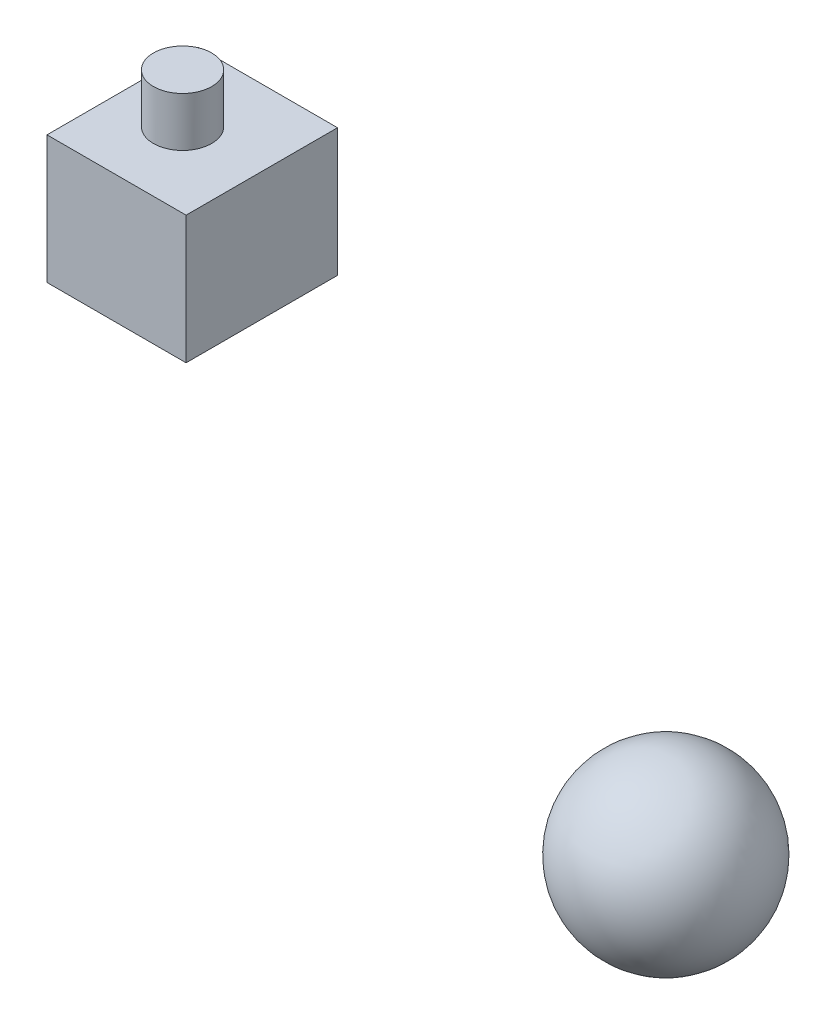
ISO-10303-21;
HEADER;
FILE_DESCRIPTION(('STEP AP214'),'2;1');
FILE_NAME('part.step','',(''),(''),'','','');
FILE_SCHEMA(('AUTOMOTIVE_DESIGN { 1 0 10303 214 1 1 1 1 }'));
ENDSEC;
DATA;
#1=APPLICATION_CONTEXT('core data for automotive mechanical design processes');
#2=APPLICATION_PROTOCOL_DEFINITION('international standard','automotive_design',2000,#1);
#3=PRODUCT_CONTEXT('',#1,'mechanical');
#4=PRODUCT('Part','Part','',(#3));
#5=PRODUCT_RELATED_PRODUCT_CATEGORY('part','',(#4));
#6=PRODUCT_DEFINITION_FORMATION('','',#4);
#7=PRODUCT_DEFINITION_CONTEXT('part definition',#1,'design');
#8=PRODUCT_DEFINITION('design','',#6,#7);
#9=PRODUCT_DEFINITION_SHAPE('','',#8);
#10=(LENGTH_UNIT() NAMED_UNIT(*) SI_UNIT(.MILLI.,.METRE.));
#11=(NAMED_UNIT(*) PLANE_ANGLE_UNIT() SI_UNIT($,.RADIAN.));
#12=(NAMED_UNIT(*) SI_UNIT($,.STERADIAN.) SOLID_ANGLE_UNIT());
#13=UNCERTAINTY_MEASURE_WITH_UNIT(LENGTH_MEASURE(1.E-05),#10,'distance_accuracy_value','');
#14=(GEOMETRIC_REPRESENTATION_CONTEXT(3) GLOBAL_UNCERTAINTY_ASSIGNED_CONTEXT((#13)) GLOBAL_UNIT_ASSIGNED_CONTEXT((#10,
#11,#12)) REPRESENTATION_CONTEXT('',''));
#15=CARTESIAN_POINT('',(0.,0.,0.));
#16=DIRECTION('',(0.,0.,1.));
#17=DIRECTION('',(1.,0.,0.));
#18=AXIS2_PLACEMENT_3D('',#15,#16,#17);
#19=CARTESIAN_POINT('',(-243.026209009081,242.066427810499,78.74));
#20=DIRECTION('',(0.,-1.,0.));
#21=DIRECTION('',(0.,0.,-1.));
#22=AXIS2_PLACEMENT_3D('',#19,#20,#21);
#23=PLANE('',#22);
#24=DIRECTION('',(-1.,0.,0.));
#25=VECTOR('',#24,1.);
#26=CARTESIAN_POINT('',(-243.026209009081,242.066427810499,0.));
#27=LINE('',#26,#25);
#28=CARTESIAN_POINT('',(-170.703852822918,242.066427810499,0.));
#29=VERTEX_POINT('',#28);
#30=CARTESIAN_POINT('',(-243.026209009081,242.066427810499,0.));
#31=VERTEX_POINT('',#30);
#32=EDGE_CURVE('E95',#29,#31,#27,.T.);
#33=ORIENTED_EDGE('',*,*,#32,.T.);
#34=DIRECTION('',(0.,0.,-1.));
#35=VECTOR('',#34,1.);
#36=CARTESIAN_POINT('',(-243.026209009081,242.066427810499,78.74));
#37=LINE('',#36,#35);
#38=CARTESIAN_POINT('',(-243.026209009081,242.066427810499,78.74));
#39=VERTEX_POINT('',#38);
#40=EDGE_CURVE('E93',#39,#31,#37,.T.);
#41=ORIENTED_EDGE('',*,*,#40,.F.);
#42=DIRECTION('',(-1.,0.,0.));
#43=VECTOR('',#42,1.);
#44=CARTESIAN_POINT('',(-243.026209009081,242.066427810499,78.74));
#45=LINE('',#44,#43);
#46=CARTESIAN_POINT('',(-170.703852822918,242.066427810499,78.74));
#47=VERTEX_POINT('',#46);
#48=EDGE_CURVE('E85',#47,#39,#45,.T.);
#49=ORIENTED_EDGE('',*,*,#48,.F.);
#50=DIRECTION('',(0.,0.,-1.));
#51=VECTOR('',#50,1.);
#52=CARTESIAN_POINT('',(-170.703852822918,242.066427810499,78.74));
#53=LINE('',#52,#51);
#54=EDGE_CURVE('E46',#47,#29,#53,.T.);
#55=ORIENTED_EDGE('',*,*,#54,.T.);
#56=EDGE_LOOP('',(#33,#41,#49,#55));
#57=FACE_BOUND('',#56,.T.);
#58=CARTESIAN_POINT('',(-211.442910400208,242.066427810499,39.8283000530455));
#59=DIRECTION('',(0.,-1.,0.));
#60=DIRECTION('',(0.,0.,-1.));
#61=AXIS2_PLACEMENT_3D('',#58,#59,#60);
#62=CIRCLE('',#61,15.1431436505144);
#63=CARTESIAN_POINT('',(-211.442910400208,242.066427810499,24.6851564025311));
#64=VERTEX_POINT('',#63);
#65=EDGE_CURVE('E12',#64,#64,#62,.F.);
#66=ORIENTED_EDGE('',*,*,#65,.F.);
#67=EDGE_LOOP('',(#66));
#68=FACE_BOUND('',#67,.T.);
#69=ADVANCED_FACE('F37',(#57,#68),#23,.F.);
#70=CARTESIAN_POINT('',(-170.703852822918,242.066427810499,78.74));
#71=DIRECTION('',(-1.,0.,0.));
#72=DIRECTION('',(0.,0.,1.));
#73=AXIS2_PLACEMENT_3D('',#70,#71,#72);
#74=PLANE('',#73);
#75=DIRECTION('',(0.,1.,0.));
#76=VECTOR('',#75,1.);
#77=CARTESIAN_POINT('',(-170.703852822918,242.066427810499,0.));
#78=LINE('',#77,#76);
#79=CARTESIAN_POINT('',(-170.703852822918,175.562643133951,0.));
#80=VERTEX_POINT('',#79);
#81=EDGE_CURVE('E104',#80,#29,#78,.T.);
#82=ORIENTED_EDGE('',*,*,#81,.T.);
#83=ORIENTED_EDGE('',*,*,#54,.F.);
#84=DIRECTION('',(0.,1.,0.));
#85=VECTOR('',#84,1.);
#86=CARTESIAN_POINT('',(-170.703852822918,242.066427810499,78.74));
#87=LINE('',#86,#85);
#88=CARTESIAN_POINT('',(-170.703852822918,175.562643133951,78.74));
#89=VERTEX_POINT('',#88);
#90=EDGE_CURVE('E90',#89,#47,#87,.T.);
#91=ORIENTED_EDGE('',*,*,#90,.F.);
#92=DIRECTION('',(0.,0.,-1.));
#93=VECTOR('',#92,1.);
#94=CARTESIAN_POINT('',(-170.703852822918,175.562643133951,78.74));
#95=LINE('',#94,#93);
#96=EDGE_CURVE('E100',#89,#80,#95,.T.);
#97=ORIENTED_EDGE('',*,*,#96,.T.);
#98=EDGE_LOOP('',(#82,#83,#91,#97));
#99=FACE_BOUND('',#98,.T.);
#100=ADVANCED_FACE('F39',(#99),#74,.F.);
#101=CARTESIAN_POINT('',(-243.026209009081,242.066427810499,78.74));
#102=DIRECTION('',(1.,0.,0.));
#103=DIRECTION('',(0.,0.,-1.));
#104=AXIS2_PLACEMENT_3D('',#101,#102,#103);
#105=PLANE('',#104);
#106=DIRECTION('',(0.,-1.,0.));
#107=VECTOR('',#106,1.);
#108=CARTESIAN_POINT('',(-243.026209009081,242.066427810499,0.));
#109=LINE('',#108,#107);
#110=CARTESIAN_POINT('',(-243.026209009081,175.562643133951,0.));
#111=VERTEX_POINT('',#110);
#112=EDGE_CURVE('E71',#31,#111,#109,.T.);
#113=ORIENTED_EDGE('',*,*,#112,.T.);
#114=DIRECTION('',(0.,0.,-1.));
#115=VECTOR('',#114,1.);
#116=CARTESIAN_POINT('',(-243.026209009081,175.562643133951,78.74));
#117=LINE('',#116,#115);
#118=CARTESIAN_POINT('',(-243.026209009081,175.562643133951,78.74));
#119=VERTEX_POINT('',#118);
#120=EDGE_CURVE('E96',#119,#111,#117,.T.);
#121=ORIENTED_EDGE('',*,*,#120,.F.);
#122=DIRECTION('',(0.,-1.,0.));
#123=VECTOR('',#122,1.);
#124=CARTESIAN_POINT('',(-243.026209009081,242.066427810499,78.74));
#125=LINE('',#124,#123);
#126=EDGE_CURVE('E88',#39,#119,#125,.T.);
#127=ORIENTED_EDGE('',*,*,#126,.F.);
#128=ORIENTED_EDGE('',*,*,#40,.T.);
#129=EDGE_LOOP('',(#113,#121,#127,#128));
#130=FACE_BOUND('',#129,.T.);
#131=ADVANCED_FACE('F98',(#130),#105,.F.);
#132=CARTESIAN_POINT('',(-243.026209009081,175.562643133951,78.74));
#133=DIRECTION('',(0.,1.,0.));
#134=DIRECTION('',(0.,0.,1.));
#135=AXIS2_PLACEMENT_3D('',#132,#133,#134);
#136=PLANE('',#135);
#137=DIRECTION('',(1.,0.,0.));
#138=VECTOR('',#137,1.);
#139=CARTESIAN_POINT('',(-243.026209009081,175.562643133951,0.));
#140=LINE('',#139,#138);
#141=EDGE_CURVE('E77',#111,#80,#140,.T.);
#142=ORIENTED_EDGE('',*,*,#141,.T.);
#143=ORIENTED_EDGE('',*,*,#96,.F.);
#144=DIRECTION('',(1.,0.,0.));
#145=VECTOR('',#144,1.);
#146=CARTESIAN_POINT('',(-243.026209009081,175.562643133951,78.74));
#147=LINE('',#146,#145);
#148=EDGE_CURVE('E54',#119,#89,#147,.T.);
#149=ORIENTED_EDGE('',*,*,#148,.F.);
#150=ORIENTED_EDGE('',*,*,#120,.T.);
#151=EDGE_LOOP('',(#142,#143,#149,#150));
#152=FACE_BOUND('',#151,.T.);
#153=ADVANCED_FACE('F126',(#152),#136,.F.);
#154=CARTESIAN_POINT('',(-170.703852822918,175.562643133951,78.74));
#155=DIRECTION('',(0.,0.,1.));
#156=DIRECTION('',(1.,0.,0.));
#157=AXIS2_PLACEMENT_3D('',#154,#155,#156);
#158=PLANE('',#157);
#159=ORIENTED_EDGE('',*,*,#90,.T.);
#160=ORIENTED_EDGE('',*,*,#48,.T.);
#161=ORIENTED_EDGE('',*,*,#126,.T.);
#162=ORIENTED_EDGE('',*,*,#148,.T.);
#163=EDGE_LOOP('',(#159,#160,#161,#162));
#164=FACE_BOUND('',#163,.T.);
#165=ADVANCED_FACE('F86',(#164),#158,.T.);
#166=CARTESIAN_POINT('',(-170.703852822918,175.562643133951,0.));
#167=DIRECTION('',(0.,0.,1.));
#168=DIRECTION('',(1.,0.,0.));
#169=AXIS2_PLACEMENT_3D('',#166,#167,#168);
#170=PLANE('',#169);
#171=ORIENTED_EDGE('',*,*,#81,.F.);
#172=ORIENTED_EDGE('',*,*,#141,.F.);
#173=ORIENTED_EDGE('',*,*,#112,.F.);
#174=ORIENTED_EDGE('',*,*,#32,.F.);
#175=EDGE_LOOP('',(#171,#172,#173,#174));
#176=FACE_BOUND('',#175,.T.);
#177=ADVANCED_FACE('F115',(#176),#170,.F.);
#178=CARTESIAN_POINT('',(-211.442910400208,267.720427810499,39.8283000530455));
#179=DIRECTION('',(0.,-1.,0.));
#180=DIRECTION('',(0.,0.,-1.));
#181=AXIS2_PLACEMENT_3D('',#178,#179,#180);
#182=CYLINDRICAL_SURFACE('',#181,15.1431436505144);
#183=CARTESIAN_POINT('',(-211.442910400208,267.720427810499,39.8283000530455));
#184=DIRECTION('',(0.,1.,0.));
#185=DIRECTION('',(0.,0.,1.));
#186=AXIS2_PLACEMENT_3D('',#183,#184,#185);
#187=CIRCLE('',#186,15.1431436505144);
#188=CARTESIAN_POINT('',(-211.442910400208,267.720427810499,54.9714437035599));
#189=VERTEX_POINT('',#188);
#190=EDGE_CURVE('E107',#189,#189,#187,.T.);
#191=ORIENTED_EDGE('',*,*,#190,.F.);
#192=EDGE_LOOP('',(#191));
#193=FACE_BOUND('',#192,.T.);
#194=ORIENTED_EDGE('',*,*,#65,.T.);
#195=EDGE_LOOP('',(#194));
#196=FACE_BOUND('',#195,.T.);
#197=ADVANCED_FACE('F117',(#193,#196),#182,.T.);
#198=CARTESIAN_POINT('',(-211.442910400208,267.720427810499,39.8283000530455));
#199=DIRECTION('',(0.,1.,0.));
#200=DIRECTION('',(0.,0.,1.));
#201=AXIS2_PLACEMENT_3D('',#198,#199,#200);
#202=PLANE('',#201);
#203=ORIENTED_EDGE('',*,*,#190,.T.);
#204=EDGE_LOOP('',(#203));
#205=FACE_BOUND('',#204,.T.);
#206=ADVANCED_FACE('F123',(#205),#202,.T.);
#207=CLOSED_SHELL('',(#69,#100,#131,#153,#165,#177,#197,#206));
#208=MANIFOLD_SOLID_BREP('B2',#207);
#209=CARTESIAN_POINT('',(0.,0.,0.));
#210=DIRECTION('',(0.,1.,0.));
#211=DIRECTION('',(1.,0.,0.));
#212=AXIS2_PLACEMENT_3D('',#209,#210,#211);
#213=SPHERICAL_SURFACE('',#212,45.3057576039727);
#214=CARTESIAN_POINT('',(0.,45.3057576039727,0.));
#215=VERTEX_POINT('',#214);
#216=VERTEX_LOOP('',#215);
#217=FACE_BOUND('',#216,.T.);
#218=ADVANCED_FACE('F191',(#217),#213,.T.);
#219=CLOSED_SHELL('',(#218));
#220=MANIFOLD_SOLID_BREP('B6',#219);
#221=ADVANCED_BREP_SHAPE_REPRESENTATION('',(#18,#208,#220),#14);
#222=SHAPE_DEFINITION_REPRESENTATION(#9,#221);
ENDSEC;
END-ISO-10303-21;
